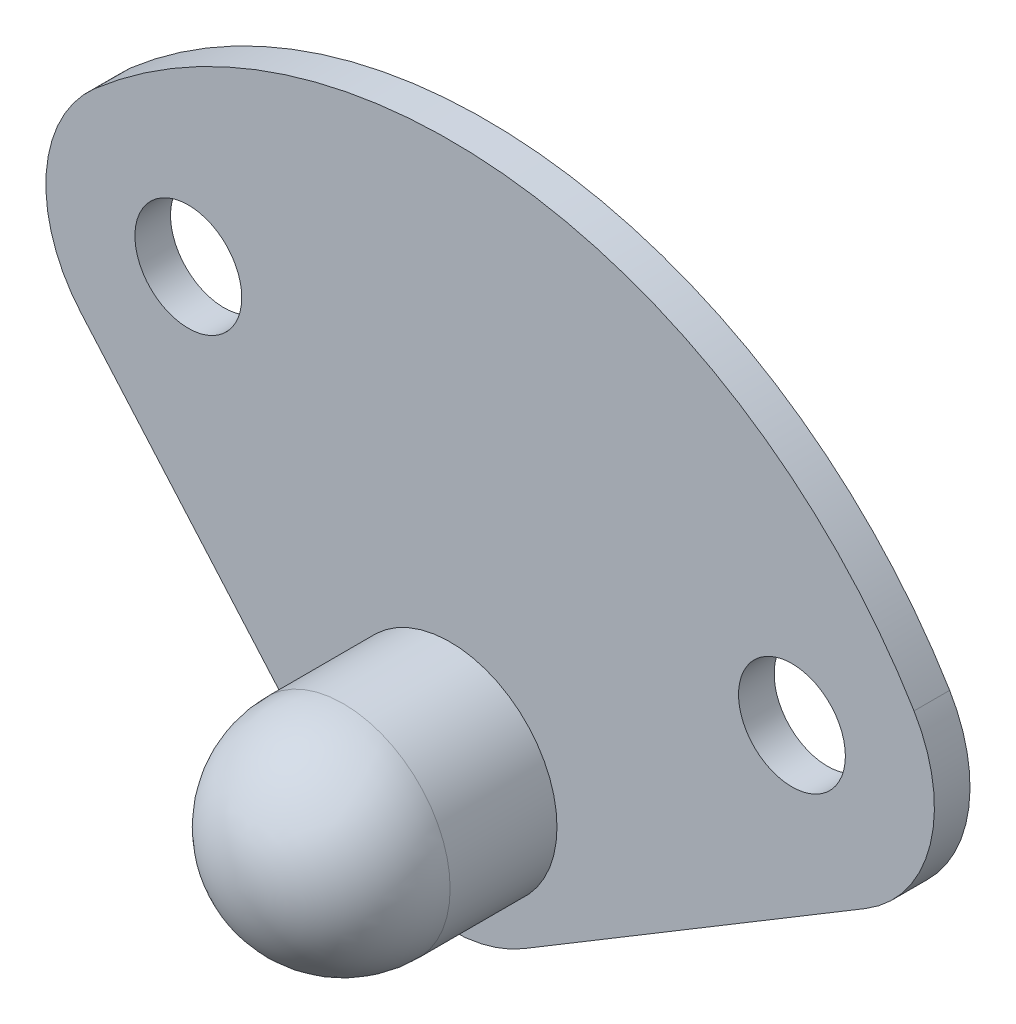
from build123d import *

# Parameters (mm, degrees)
ESQUISSE1_R             = 30
ESQUISSE1_R_2           = 15
BOSS_EXTRU_1_DEPTH      = 10
BOSS_EXTRU_2_DEPTH      = 40
BOSS_EXTRU_2_DEPTH_BACK = 30
ESQUISSE2_R             = 30
ESQUISSE2_R_2           = 27


with BuildPart() as part:
    # Esquisse1 → Boss.-Extru.1 (new body)
    with BuildSketch(Plane.XY):
        with BuildLine():
            Line((-30.176382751, -26.256159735), (-103.69363001, 58.237711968))
            ThreePointArc((-103.69363001, 58.237711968), (-113.421080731, 87.265887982), (-99.773406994, 114.670254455))
            ThreePointArc((-99.773406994, 114.670254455), (23.709401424, 150.139482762), (130.253625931, 78.345344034))
            ThreePointArc((130.253625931, 78.345344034), (134.792604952, 48.069017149), (116.593551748, 23.450878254))
            Line((116.593551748, 23.450878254), (20.617195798, -34.277269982))
            ThreePointArc((20.617195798, -34.277269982), (-6.239316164, -39.510390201), (-30.176382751, -26.256159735))
        make_face()
        Circle(ESQUISSE1_R, mode=Mode.SUBTRACT)
        with Locations((95.976355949, 57.728148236)):
            Circle(ESQUISSE1_R_2, mode=Mode.SUBTRACT)
        with Locations((-73.517247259, 84.493871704)):
            Circle(ESQUISSE1_R_2, mode=Mode.SUBTRACT)
    extrude(amount=BOSS_EXTRU_1_DEPTH)

    # Esquisse2 → Boss.-Extru.2 (add, two sides: drawn at the far end of the back side and taken through both)
    with BuildSketch(Plane.XY.offset(-BOSS_EXTRU_2_DEPTH_BACK)):
        Circle(ESQUISSE2_R)
        Circle(ESQUISSE2_R_2, mode=Mode.SUBTRACT)
    extrude(amount=BOSS_EXTRU_2_DEPTH + BOSS_EXTRU_2_DEPTH_BACK)

    # Esquisse3 → R_volution1 (revolve)
    with BuildSketch(Plane(origin=(0, 0, 0), x_dir=(0, 0, -1), z_dir=(1, 0, 0)), mode=Mode.PRIVATE) as r_volution1_sk:
        with BuildLine():
            Line((-40, 30), (-40, 0))
            Line((-40, 0), (-70, 0))
            ThreePointArc((-70, 0), (-61.213203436, 21.213203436), (-40, 30))
        make_face()
    revolve(r_volution1_sk.sketch.rotate(Axis((0, 0, 0), (0, 0, 1)), 270), axis=Axis((0, 0, 0), (0, 0, 1)))


solid = part.part
